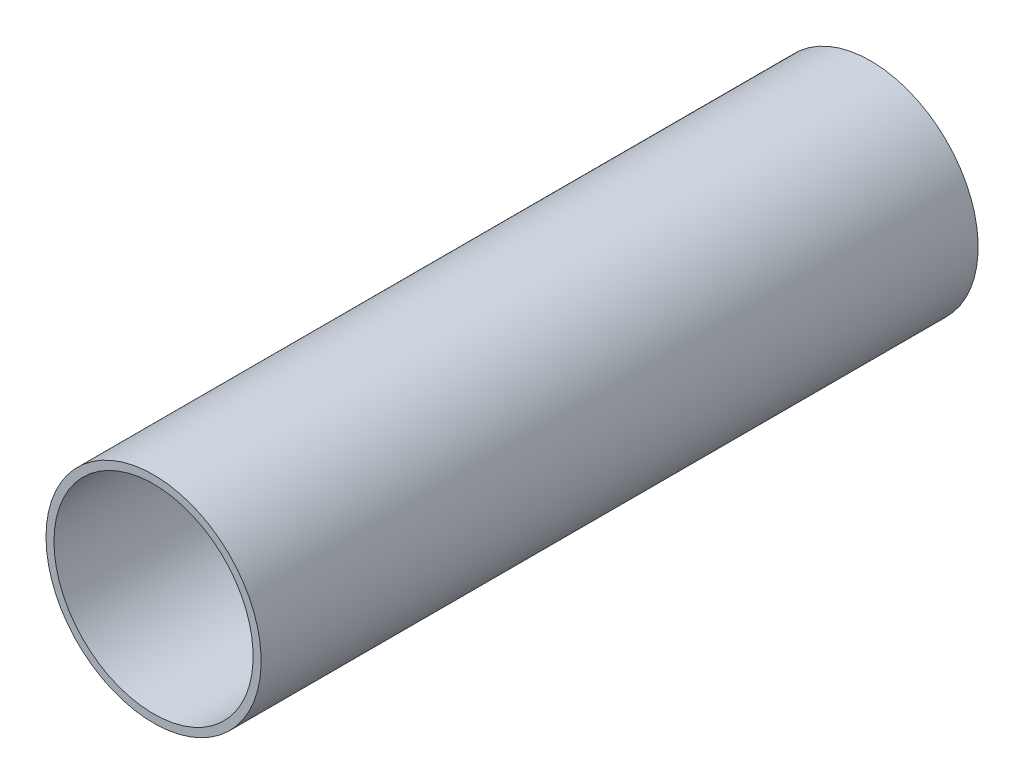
ISO-10303-21;
HEADER;
FILE_DESCRIPTION(('STEP AP214'),'2;1');
FILE_NAME('part.step','',(''),(''),'','','');
FILE_SCHEMA(('AUTOMOTIVE_DESIGN { 1 0 10303 214 1 1 1 1 }'));
ENDSEC;
DATA;
#1=APPLICATION_CONTEXT('core data for automotive mechanical design processes');
#2=APPLICATION_PROTOCOL_DEFINITION('international standard','automotive_design',2000,#1);
#3=PRODUCT_CONTEXT('',#1,'mechanical');
#4=PRODUCT('Part','Part','',(#3));
#5=PRODUCT_RELATED_PRODUCT_CATEGORY('part','',(#4));
#6=PRODUCT_DEFINITION_FORMATION('','',#4);
#7=PRODUCT_DEFINITION_CONTEXT('part definition',#1,'design');
#8=PRODUCT_DEFINITION('design','',#6,#7);
#9=PRODUCT_DEFINITION_SHAPE('','',#8);
#10=(LENGTH_UNIT() NAMED_UNIT(*) SI_UNIT(.MILLI.,.METRE.));
#11=(NAMED_UNIT(*) PLANE_ANGLE_UNIT() SI_UNIT($,.RADIAN.));
#12=(NAMED_UNIT(*) SI_UNIT($,.STERADIAN.) SOLID_ANGLE_UNIT());
#13=UNCERTAINTY_MEASURE_WITH_UNIT(LENGTH_MEASURE(1.E-05),#10,'distance_accuracy_value','');
#14=(GEOMETRIC_REPRESENTATION_CONTEXT(3) GLOBAL_UNCERTAINTY_ASSIGNED_CONTEXT((#13)) GLOBAL_UNIT_ASSIGNED_CONTEXT((#10,
#11,#12)) REPRESENTATION_CONTEXT('',''));
#15=CARTESIAN_POINT('',(0.,0.,0.));
#16=DIRECTION('',(0.,0.,1.));
#17=DIRECTION('',(1.,0.,0.));
#18=AXIS2_PLACEMENT_3D('',#15,#16,#17);
#19=CARTESIAN_POINT('',(0.,0.,90.));
#20=DIRECTION('',(0.,0.,1.));
#21=DIRECTION('',(1.,0.,0.));
#22=AXIS2_PLACEMENT_3D('',#19,#20,#21);
#23=PLANE('',#22);
#24=CARTESIAN_POINT('',(0.,0.,90.));
#25=DIRECTION('',(0.,0.,1.));
#26=DIRECTION('',(1.,0.,0.));
#27=AXIS2_PLACEMENT_3D('',#24,#25,#26);
#28=CIRCLE('',#27,27.);
#29=CARTESIAN_POINT('',(-27.,0.,90.));
#30=VERTEX_POINT('',#29);
#31=EDGE_CURVE('E10',#30,#30,#28,.T.);
#32=ORIENTED_EDGE('',*,*,#31,.T.);
#33=EDGE_LOOP('',(#32));
#34=FACE_BOUND('',#33,.T.);
#35=CARTESIAN_POINT('',(0.,0.,90.));
#36=DIRECTION('',(0.,0.,1.));
#37=DIRECTION('',(1.,0.,0.));
#38=AXIS2_PLACEMENT_3D('',#35,#36,#37);
#39=CIRCLE('',#38,25.);
#40=CARTESIAN_POINT('',(-25.,0.,90.));
#41=VERTEX_POINT('',#40);
#42=EDGE_CURVE('E45',#41,#41,#39,.T.);
#43=ORIENTED_EDGE('',*,*,#42,.F.);
#44=EDGE_LOOP('',(#43));
#45=FACE_BOUND('',#44,.T.);
#46=ADVANCED_FACE('F37',(#34,#45),#23,.T.);
#47=CARTESIAN_POINT('',(0.,0.,90.));
#48=DIRECTION('',(0.,0.,-1.));
#49=DIRECTION('',(-1.,0.,0.));
#50=AXIS2_PLACEMENT_3D('',#47,#48,#49);
#51=CYLINDRICAL_SURFACE('',#50,27.);
#52=CARTESIAN_POINT('',(0.,0.,-90.));
#53=DIRECTION('',(0.,0.,1.));
#54=DIRECTION('',(1.,0.,0.));
#55=AXIS2_PLACEMENT_3D('',#52,#53,#54);
#56=CIRCLE('',#55,27.);
#57=CARTESIAN_POINT('',(-27.,0.,-90.));
#58=VERTEX_POINT('',#57);
#59=EDGE_CURVE('E50',#58,#58,#56,.T.);
#60=CARTESIAN_POINT('',(-27.,0.,90.));
#61=CARTESIAN_POINT('',(-27.,0.,88.125));
#62=CARTESIAN_POINT('',(-27.,0.,86.25));
#63=CARTESIAN_POINT('',(-27.,0.,82.5));
#64=CARTESIAN_POINT('',(-27.,0.,80.625));
#65=CARTESIAN_POINT('',(-27.,0.,76.875));
#66=CARTESIAN_POINT('',(-27.,0.,75.));
#67=CARTESIAN_POINT('',(-27.,0.,71.25));
#68=CARTESIAN_POINT('',(-27.,0.,69.375));
#69=CARTESIAN_POINT('',(-27.,0.,65.625));
#70=CARTESIAN_POINT('',(-27.,0.,63.75));
#71=CARTESIAN_POINT('',(-27.,0.,60.));
#72=CARTESIAN_POINT('',(-27.,0.,58.125));
#73=CARTESIAN_POINT('',(-27.,0.,54.375));
#74=CARTESIAN_POINT('',(-27.,0.,52.5));
#75=CARTESIAN_POINT('',(-27.,0.,48.75));
#76=CARTESIAN_POINT('',(-27.,0.,46.875));
#77=CARTESIAN_POINT('',(-27.,0.,43.125));
#78=CARTESIAN_POINT('',(-27.,0.,41.25));
#79=CARTESIAN_POINT('',(-27.,0.,37.5));
#80=CARTESIAN_POINT('',(-27.,0.,35.625));
#81=CARTESIAN_POINT('',(-27.,0.,31.875));
#82=CARTESIAN_POINT('',(-27.,0.,30.));
#83=CARTESIAN_POINT('',(-27.,0.,26.25));
#84=CARTESIAN_POINT('',(-27.,0.,24.375));
#85=CARTESIAN_POINT('',(-27.,0.,20.625));
#86=CARTESIAN_POINT('',(-27.,0.,18.75));
#87=CARTESIAN_POINT('',(-27.,0.,15.));
#88=CARTESIAN_POINT('',(-27.,0.,13.125));
#89=CARTESIAN_POINT('',(-27.,0.,9.37499999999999));
#90=CARTESIAN_POINT('',(-27.,0.,7.49999999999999));
#91=CARTESIAN_POINT('',(-27.,0.,3.74999999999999));
#92=CARTESIAN_POINT('',(-27.,0.,1.87499999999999));
#93=CARTESIAN_POINT('',(-27.,0.,-1.87500000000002));
#94=CARTESIAN_POINT('',(-27.,0.,-3.75000000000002));
#95=CARTESIAN_POINT('',(-27.,0.,-7.50000000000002));
#96=CARTESIAN_POINT('',(-27.,0.,-9.37500000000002));
#97=CARTESIAN_POINT('',(-27.,0.,-13.125));
#98=CARTESIAN_POINT('',(-27.,0.,-15.));
#99=CARTESIAN_POINT('',(-27.,0.,-18.75));
#100=CARTESIAN_POINT('',(-27.,0.,-20.625));
#101=CARTESIAN_POINT('',(-27.,0.,-24.375));
#102=CARTESIAN_POINT('',(-27.,0.,-26.25));
#103=CARTESIAN_POINT('',(-27.,0.,-30.));
#104=CARTESIAN_POINT('',(-27.,0.,-31.875));
#105=CARTESIAN_POINT('',(-27.,0.,-35.625));
#106=CARTESIAN_POINT('',(-27.,0.,-37.5));
#107=CARTESIAN_POINT('',(-27.,0.,-41.25));
#108=CARTESIAN_POINT('',(-27.,0.,-43.125));
#109=CARTESIAN_POINT('',(-27.,0.,-46.875));
#110=CARTESIAN_POINT('',(-27.,0.,-48.75));
#111=CARTESIAN_POINT('',(-27.,0.,-52.5));
#112=CARTESIAN_POINT('',(-27.,0.,-54.375));
#113=CARTESIAN_POINT('',(-27.,0.,-58.125));
#114=CARTESIAN_POINT('',(-27.,0.,-60.));
#115=CARTESIAN_POINT('',(-27.,0.,-63.75));
#116=CARTESIAN_POINT('',(-27.,0.,-65.625));
#117=CARTESIAN_POINT('',(-27.,0.,-69.375));
#118=CARTESIAN_POINT('',(-27.,0.,-71.25));
#119=CARTESIAN_POINT('',(-27.,0.,-75.));
#120=CARTESIAN_POINT('',(-27.,0.,-76.875));
#121=CARTESIAN_POINT('',(-27.,0.,-80.625));
#122=CARTESIAN_POINT('',(-27.,0.,-82.5));
#123=CARTESIAN_POINT('',(-27.,0.,-86.25));
#124=CARTESIAN_POINT('',(-27.,0.,-88.125));
#125=CARTESIAN_POINT('',(-27.,0.,-90.));
#126=B_SPLINE_CURVE_WITH_KNOTS('',3,(#60,#61,#62,#63,#64,#65,#66,#67,#68,#69,#70,#71,#72,#73,
#74,#75,#76,#77,#78,#79,#80,#81,#82,#83,#84,#85,#86,#87,#88,#89,#90,#91,#92,#93,#94,#95,#96,#97,
#98,#99,#100,#101,#102,#103,#104,#105,#106,#107,#108,#109,#110,#111,#112,#113,#114,#115,#116,
#117,#118,#119,#120,#121,#122,#123,#124,#125),.UNSPECIFIED.,.F.,.F.,(4,2,2,2,2,2,2,2,2,2,2,2,2,
2,2,2,2,2,2,2,2,2,2,2,2,2,2,2,2,2,2,2,4),(0.,5.62500000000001,11.25,16.875,22.5,28.125,33.75,
39.375,45.,50.625,56.25,61.875,67.5,73.125,78.75,84.375,90.,95.625,101.25,106.875,112.5,118.125,
123.75,129.375,135.,140.625,146.25,151.875,157.5,163.125,168.75,174.375,180.),.UNSPECIFIED.);
#127=EDGE_CURVE('BSEAM39',#30,#58,#126,.T.);
#128=ORIENTED_EDGE('',*,*,#31,.F.);
#129=ORIENTED_EDGE('',*,*,#59,.T.);
#130=ORIENTED_EDGE('',*,*,#127,.T.);
#131=ORIENTED_EDGE('',*,*,#127,.F.);
#132=EDGE_LOOP('',(#128,#130,#129,#131));
#133=FACE_BOUND('',#132,.T.);
#134=ADVANCED_FACE('F39',(#133),#51,.T.);
#135=CARTESIAN_POINT('',(0.,0.,90.));
#136=DIRECTION('',(0.,0.,-1.));
#137=DIRECTION('',(-1.,0.,0.));
#138=AXIS2_PLACEMENT_3D('',#135,#136,#137);
#139=CYLINDRICAL_SURFACE('',#138,25.);
#140=CARTESIAN_POINT('',(0.,0.,-90.));
#141=DIRECTION('',(0.,0.,1.));
#142=DIRECTION('',(1.,0.,0.));
#143=AXIS2_PLACEMENT_3D('',#140,#141,#142);
#144=CIRCLE('',#143,25.);
#145=CARTESIAN_POINT('',(-25.,0.,-90.));
#146=VERTEX_POINT('',#145);
#147=EDGE_CURVE('E55',#146,#146,#144,.T.);
#148=CARTESIAN_POINT('',(-25.,0.,90.));
#149=CARTESIAN_POINT('',(-25.,0.,88.125));
#150=CARTESIAN_POINT('',(-25.,0.,86.25));
#151=CARTESIAN_POINT('',(-25.,0.,82.5));
#152=CARTESIAN_POINT('',(-25.,0.,80.625));
#153=CARTESIAN_POINT('',(-25.,0.,76.875));
#154=CARTESIAN_POINT('',(-25.,0.,75.));
#155=CARTESIAN_POINT('',(-25.,0.,71.25));
#156=CARTESIAN_POINT('',(-25.,0.,69.375));
#157=CARTESIAN_POINT('',(-25.,0.,65.625));
#158=CARTESIAN_POINT('',(-25.,0.,63.75));
#159=CARTESIAN_POINT('',(-25.,0.,60.));
#160=CARTESIAN_POINT('',(-25.,0.,58.125));
#161=CARTESIAN_POINT('',(-25.,0.,54.375));
#162=CARTESIAN_POINT('',(-25.,0.,52.5));
#163=CARTESIAN_POINT('',(-25.,0.,48.75));
#164=CARTESIAN_POINT('',(-25.,0.,46.875));
#165=CARTESIAN_POINT('',(-25.,0.,43.125));
#166=CARTESIAN_POINT('',(-25.,0.,41.25));
#167=CARTESIAN_POINT('',(-25.,0.,37.5));
#168=CARTESIAN_POINT('',(-25.,0.,35.625));
#169=CARTESIAN_POINT('',(-25.,0.,31.875));
#170=CARTESIAN_POINT('',(-25.,0.,30.));
#171=CARTESIAN_POINT('',(-25.,0.,26.25));
#172=CARTESIAN_POINT('',(-25.,0.,24.375));
#173=CARTESIAN_POINT('',(-25.,0.,20.625));
#174=CARTESIAN_POINT('',(-25.,0.,18.75));
#175=CARTESIAN_POINT('',(-25.,0.,15.));
#176=CARTESIAN_POINT('',(-25.,0.,13.125));
#177=CARTESIAN_POINT('',(-25.,0.,9.37499999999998));
#178=CARTESIAN_POINT('',(-25.,0.,7.49999999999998));
#179=CARTESIAN_POINT('',(-25.,0.,3.74999999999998));
#180=CARTESIAN_POINT('',(-25.,0.,1.87499999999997));
#181=CARTESIAN_POINT('',(-25.,0.,-1.87500000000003));
#182=CARTESIAN_POINT('',(-25.,0.,-3.75000000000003));
#183=CARTESIAN_POINT('',(-25.,0.,-7.50000000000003));
#184=CARTESIAN_POINT('',(-25.,0.,-9.37500000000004));
#185=CARTESIAN_POINT('',(-25.,0.,-13.125));
#186=CARTESIAN_POINT('',(-25.,0.,-15.));
#187=CARTESIAN_POINT('',(-25.,0.,-18.75));
#188=CARTESIAN_POINT('',(-25.,0.,-20.625));
#189=CARTESIAN_POINT('',(-25.,0.,-24.375));
#190=CARTESIAN_POINT('',(-25.,0.,-26.25));
#191=CARTESIAN_POINT('',(-25.,0.,-30.));
#192=CARTESIAN_POINT('',(-25.,0.,-31.875));
#193=CARTESIAN_POINT('',(-25.,0.,-35.625));
#194=CARTESIAN_POINT('',(-25.,0.,-37.5));
#195=CARTESIAN_POINT('',(-25.,0.,-41.25));
#196=CARTESIAN_POINT('',(-25.,0.,-43.125));
#197=CARTESIAN_POINT('',(-25.,0.,-46.875));
#198=CARTESIAN_POINT('',(-25.,0.,-48.75));
#199=CARTESIAN_POINT('',(-25.,0.,-52.5));
#200=CARTESIAN_POINT('',(-25.,0.,-54.375));
#201=CARTESIAN_POINT('',(-25.,0.,-58.125));
#202=CARTESIAN_POINT('',(-25.,0.,-60.));
#203=CARTESIAN_POINT('',(-25.,0.,-63.75));
#204=CARTESIAN_POINT('',(-25.,0.,-65.625));
#205=CARTESIAN_POINT('',(-25.,0.,-69.375));
#206=CARTESIAN_POINT('',(-25.,0.,-71.25));
#207=CARTESIAN_POINT('',(-25.,0.,-75.));
#208=CARTESIAN_POINT('',(-25.,0.,-76.875));
#209=CARTESIAN_POINT('',(-25.,0.,-80.625));
#210=CARTESIAN_POINT('',(-25.,0.,-82.5));
#211=CARTESIAN_POINT('',(-25.,0.,-86.25));
#212=CARTESIAN_POINT('',(-25.,0.,-88.125));
#213=CARTESIAN_POINT('',(-25.,0.,-90.));
#214=B_SPLINE_CURVE_WITH_KNOTS('',3,(#148,#149,#150,#151,#152,#153,#154,#155,#156,#157,#158,
#159,#160,#161,#162,#163,#164,#165,#166,#167,#168,#169,#170,#171,#172,#173,#174,#175,#176,#177,
#178,#179,#180,#181,#182,#183,#184,#185,#186,#187,#188,#189,#190,#191,#192,#193,#194,#195,#196,
#197,#198,#199,#200,#201,#202,#203,#204,#205,#206,#207,#208,#209,#210,#211,#212,#213),
.UNSPECIFIED.,.F.,.F.,(4,2,2,2,2,2,2,2,2,2,2,2,2,2,2,2,2,2,2,2,2,2,2,2,2,2,2,2,2,2,2,2,4),(0.,
5.62499999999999,11.25,16.875,22.5,28.125,33.75,39.375,45.,50.625,56.25,61.875,67.5,73.125,
78.75,84.375,90.,95.625,101.25,106.875,112.5,118.125,123.75,129.375,135.,140.625,146.25,151.875,
157.5,163.125,168.75,174.375,180.),.UNSPECIFIED.);
#215=EDGE_CURVE('BSEAM65',#41,#146,#214,.T.);
#216=ORIENTED_EDGE('',*,*,#42,.T.);
#217=ORIENTED_EDGE('',*,*,#147,.F.);
#218=ORIENTED_EDGE('',*,*,#215,.T.);
#219=ORIENTED_EDGE('',*,*,#215,.F.);
#220=EDGE_LOOP('',(#216,#218,#217,#219));
#221=FACE_BOUND('',#220,.T.);
#222=ADVANCED_FACE('F65',(#221),#139,.F.);
#223=CARTESIAN_POINT('',(0.,0.,-90.));
#224=DIRECTION('',(0.,0.,1.));
#225=DIRECTION('',(1.,0.,0.));
#226=AXIS2_PLACEMENT_3D('',#223,#224,#225);
#227=PLANE('',#226);
#228=ORIENTED_EDGE('',*,*,#147,.T.);
#229=EDGE_LOOP('',(#228));
#230=FACE_BOUND('',#229,.T.);
#231=ORIENTED_EDGE('',*,*,#59,.F.);
#232=EDGE_LOOP('',(#231));
#233=FACE_BOUND('',#232,.T.);
#234=ADVANCED_FACE('F62',(#230,#233),#227,.F.);
#235=CLOSED_SHELL('',(#46,#134,#222,#234));
#236=MANIFOLD_SOLID_BREP('B2',#235);
#237=ADVANCED_BREP_SHAPE_REPRESENTATION('',(#18,#236),#14);
#238=SHAPE_DEFINITION_REPRESENTATION(#9,#237);
ENDSEC;
END-ISO-10303-21;
